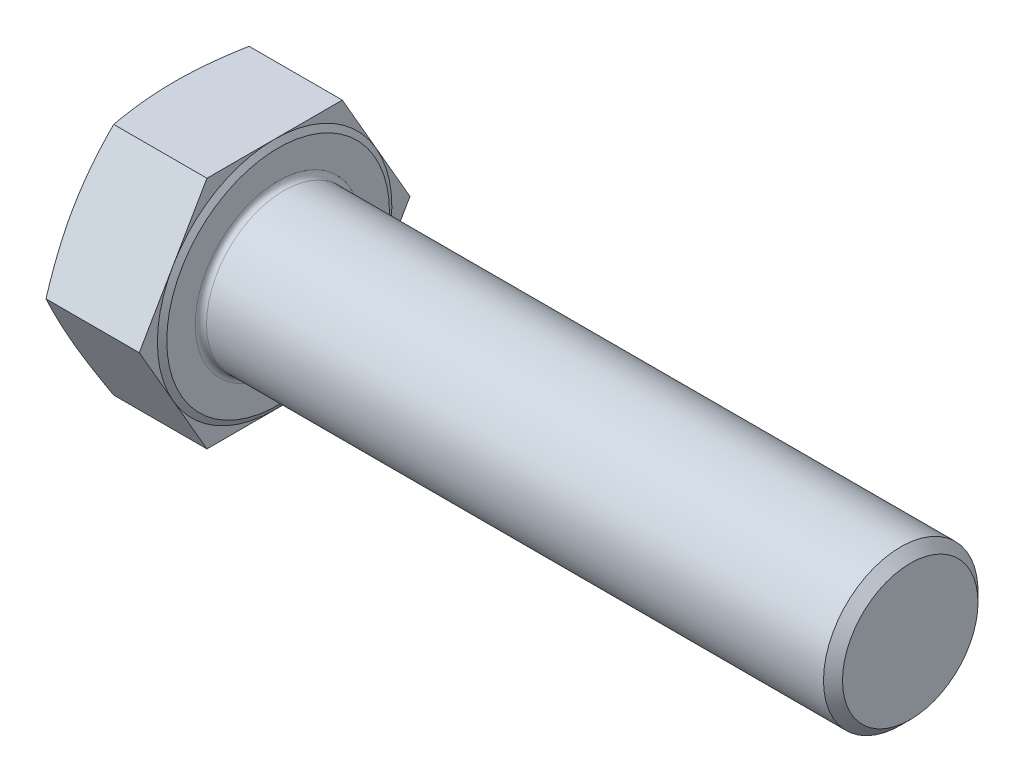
ISO-10303-21;
HEADER;
FILE_DESCRIPTION(('STEP AP214'),'2;1');
FILE_NAME('part.step','',(''),(''),'','','');
FILE_SCHEMA(('AUTOMOTIVE_DESIGN { 1 0 10303 214 1 1 1 1 }'));
ENDSEC;
DATA;
#1=APPLICATION_CONTEXT('core data for automotive mechanical design processes');
#2=APPLICATION_PROTOCOL_DEFINITION('international standard','automotive_design',2000,#1);
#3=PRODUCT_CONTEXT('',#1,'mechanical');
#4=PRODUCT('Part','Part','',(#3));
#5=PRODUCT_RELATED_PRODUCT_CATEGORY('part','',(#4));
#6=PRODUCT_DEFINITION_FORMATION('','',#4);
#7=PRODUCT_DEFINITION_CONTEXT('part definition',#1,'design');
#8=PRODUCT_DEFINITION('design','',#6,#7);
#9=PRODUCT_DEFINITION_SHAPE('','',#8);
#10=(LENGTH_UNIT() NAMED_UNIT(*) SI_UNIT(.MILLI.,.METRE.));
#11=(NAMED_UNIT(*) PLANE_ANGLE_UNIT() SI_UNIT($,.RADIAN.));
#12=(NAMED_UNIT(*) SI_UNIT($,.STERADIAN.) SOLID_ANGLE_UNIT());
#13=UNCERTAINTY_MEASURE_WITH_UNIT(LENGTH_MEASURE(1.E-05),#10,'distance_accuracy_value','');
#14=(GEOMETRIC_REPRESENTATION_CONTEXT(3) GLOBAL_UNCERTAINTY_ASSIGNED_CONTEXT((#13)) GLOBAL_UNIT_ASSIGNED_CONTEXT((#10,
#11,#12)) REPRESENTATION_CONTEXT('',''));
#15=CARTESIAN_POINT('',(0.,0.,0.));
#16=DIRECTION('',(0.,0.,1.));
#17=DIRECTION('',(1.,0.,0.));
#18=AXIS2_PLACEMENT_3D('',#15,#16,#17);
#19=CARTESIAN_POINT('',(14.72,0.,0.));
#20=DIRECTION('',(1.,0.,0.));
#21=DIRECTION('',(0.,0.,-1.));
#22=AXIS2_PLACEMENT_3D('',#19,#20,#21);
#23=PLANE('',#22);
#24=CARTESIAN_POINT('',(14.72,0.,0.));
#25=DIRECTION('',(1.,0.,0.));
#26=DIRECTION('',(0.,0.,-1.));
#27=AXIS2_PLACEMENT_3D('',#24,#25,#26);
#28=CIRCLE('',#27,11.8);
#29=CARTESIAN_POINT('',(14.72,0.,-11.8));
#30=VERTEX_POINT('',#29);
#31=EDGE_CURVE('E188',#30,#30,#28,.F.);
#32=ORIENTED_EDGE('',*,*,#31,.T.);
#33=EDGE_LOOP('',(#32));
#34=FACE_BOUND('',#33,.T.);
#35=CARTESIAN_POINT('',(14.72,0.,0.));
#36=DIRECTION('',(-1.,0.,0.));
#37=DIRECTION('',(0.,0.,1.));
#38=AXIS2_PLACEMENT_3D('',#35,#36,#37);
#39=CIRCLE('',#38,15.855);
#40=CARTESIAN_POINT('',(14.72,0.,15.855));
#41=VERTEX_POINT('',#40);
#42=EDGE_CURVE('E139',#41,#41,#39,.T.);
#43=ORIENTED_EDGE('',*,*,#42,.F.);
#44=EDGE_LOOP('',(#43));
#45=FACE_BOUND('',#44,.T.);
#46=ADVANCED_FACE('F33',(#34,#45),#23,.T.);
#47=CARTESIAN_POINT('',(14.22,0.,-19.2719519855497));
#48=DIRECTION('',(1.,0.,0.));
#49=DIRECTION('',(0.,0.,-1.));
#50=AXIS2_PLACEMENT_3D('',#47,#48,#49);
#51=PLANE('',#50);
#52=DIRECTION('',(0.,-0.866025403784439,0.5));
#53=VECTOR('',#52,1.);
#54=CARTESIAN_POINT('',(14.22,16.69,9.63597599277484));
#55=LINE('',#54,#53);
#56=CARTESIAN_POINT('',(14.22,16.69,9.63597599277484));
#57=VERTEX_POINT('',#56);
#58=CARTESIAN_POINT('',(14.22,8.345,14.4539639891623));
#59=VERTEX_POINT('',#58);
#60=EDGE_CURVE('E138',#57,#59,#55,.T.);
#61=ORIENTED_EDGE('',*,*,#60,.T.);
#62=CARTESIAN_POINT('',(14.22,0.,0.));
#63=DIRECTION('',(-1.,0.,0.));
#64=DIRECTION('',(0.,0.,1.));
#65=AXIS2_PLACEMENT_3D('',#62,#63,#64);
#66=CIRCLE('',#65,16.69);
#67=CARTESIAN_POINT('',(14.22,16.69,0.));
#68=VERTEX_POINT('',#67);
#69=EDGE_CURVE('E49',#59,#68,#66,.T.);
#70=ORIENTED_EDGE('',*,*,#69,.T.);
#71=DIRECTION('',(0.,0.,1.));
#72=VECTOR('',#71,1.);
#73=CARTESIAN_POINT('',(14.22,16.69,-9.63597599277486));
#74=LINE('',#73,#72);
#75=EDGE_CURVE('E135',#68,#57,#74,.T.);
#76=ORIENTED_EDGE('',*,*,#75,.T.);
#77=EDGE_LOOP('',(#61,#70,#76));
#78=FACE_BOUND('',#77,.T.);
#79=ADVANCED_FACE('F134',(#78),#51,.T.);
#80=CARTESIAN_POINT('',(14.22,16.69,-9.63597599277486));
#81=VERTEX_POINT('',#80);
#82=EDGE_CURVE('E145',#81,#68,#74,.T.);
#83=ORIENTED_EDGE('',*,*,#82,.T.);
#84=CARTESIAN_POINT('',(14.22,8.345,-14.4539639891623));
#85=VERTEX_POINT('',#84);
#86=EDGE_CURVE('E122',#68,#85,#66,.T.);
#87=ORIENTED_EDGE('',*,*,#86,.T.);
#88=DIRECTION('',(0.,0.866025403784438,0.5));
#89=VECTOR('',#88,1.);
#90=CARTESIAN_POINT('',(14.22,0.,-19.2719519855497));
#91=LINE('',#90,#89);
#92=EDGE_CURVE('E151',#85,#81,#91,.T.);
#93=ORIENTED_EDGE('',*,*,#92,.T.);
#94=EDGE_LOOP('',(#83,#87,#93));
#95=FACE_BOUND('',#94,.T.);
#96=ADVANCED_FACE('F150',(#95),#51,.T.);
#97=CARTESIAN_POINT('',(14.22,0.,-19.2719519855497));
#98=VERTEX_POINT('',#97);
#99=EDGE_CURVE('E148',#98,#85,#91,.T.);
#100=ORIENTED_EDGE('',*,*,#99,.T.);
#101=CARTESIAN_POINT('',(14.22,-8.345,-14.4539639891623));
#102=VERTEX_POINT('',#101);
#103=EDGE_CURVE('E125',#85,#102,#66,.T.);
#104=ORIENTED_EDGE('',*,*,#103,.T.);
#105=DIRECTION('',(0.,0.866025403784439,-0.5));
#106=VECTOR('',#105,1.);
#107=CARTESIAN_POINT('',(14.22,-16.69,-9.63597599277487));
#108=LINE('',#107,#106);
#109=EDGE_CURVE('E306',#102,#98,#108,.T.);
#110=ORIENTED_EDGE('',*,*,#109,.T.);
#111=EDGE_LOOP('',(#100,#104,#110));
#112=FACE_BOUND('',#111,.T.);
#113=ADVANCED_FACE('F337',(#112),#51,.T.);
#114=CARTESIAN_POINT('',(14.22,-16.69,-9.63597599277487));
#115=VERTEX_POINT('',#114);
#116=EDGE_CURVE('E304',#115,#102,#108,.T.);
#117=ORIENTED_EDGE('',*,*,#116,.T.);
#118=CARTESIAN_POINT('',(14.22,-16.69,0.));
#119=VERTEX_POINT('',#118);
#120=EDGE_CURVE('E338',#102,#119,#66,.T.);
#121=ORIENTED_EDGE('',*,*,#120,.T.);
#122=DIRECTION('',(0.,0.,-1.));
#123=VECTOR('',#122,1.);
#124=CARTESIAN_POINT('',(14.22,-16.69,9.63597599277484));
#125=LINE('',#124,#123);
#126=EDGE_CURVE('E162',#119,#115,#125,.T.);
#127=ORIENTED_EDGE('',*,*,#126,.T.);
#128=EDGE_LOOP('',(#117,#121,#127));
#129=FACE_BOUND('',#128,.T.);
#130=ADVANCED_FACE('F352',(#129),#51,.T.);
#131=CARTESIAN_POINT('',(14.22,-16.69,9.63597599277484));
#132=VERTEX_POINT('',#131);
#133=EDGE_CURVE('E163',#132,#119,#125,.T.);
#134=ORIENTED_EDGE('',*,*,#133,.T.);
#135=CARTESIAN_POINT('',(14.22,-8.345,14.4539639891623));
#136=VERTEX_POINT('',#135);
#137=EDGE_CURVE('E339',#119,#136,#66,.T.);
#138=ORIENTED_EDGE('',*,*,#137,.T.);
#139=DIRECTION('',(0.,-0.866025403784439,-0.5));
#140=VECTOR('',#139,1.);
#141=CARTESIAN_POINT('',(14.22,0.,19.2719519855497));
#142=LINE('',#141,#140);
#143=EDGE_CURVE('E158',#136,#132,#142,.T.);
#144=ORIENTED_EDGE('',*,*,#143,.T.);
#145=EDGE_LOOP('',(#134,#138,#144));
#146=FACE_BOUND('',#145,.T.);
#147=ADVANCED_FACE('F347',(#146),#51,.T.);
#148=CARTESIAN_POINT('',(14.22,0.,19.2719519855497));
#149=VERTEX_POINT('',#148);
#150=EDGE_CURVE('E159',#149,#136,#142,.T.);
#151=ORIENTED_EDGE('',*,*,#150,.T.);
#152=EDGE_CURVE('E140',#136,#59,#66,.T.);
#153=ORIENTED_EDGE('',*,*,#152,.T.);
#154=EDGE_CURVE('E153',#59,#149,#55,.T.);
#155=ORIENTED_EDGE('',*,*,#154,.T.);
#156=EDGE_LOOP('',(#151,#153,#155));
#157=FACE_BOUND('',#156,.T.);
#158=ADVANCED_FACE('F213',(#157),#51,.T.);
#159=CARTESIAN_POINT('',(14.22,-16.69,-9.63597599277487));
#160=DIRECTION('',(0.,0.5,0.866025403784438));
#161=DIRECTION('',(0.,-0.866025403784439,0.5));
#162=AXIS2_PLACEMENT_3D('',#159,#160,#161);
#163=PLANE('',#162);
#164=CARTESIAN_POINT('',(0.939795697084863,0.000200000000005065,-19.2720674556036));
#165=CARTESIAN_POINT('',(0.867168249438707,-0.345441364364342,-19.0725113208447));
#166=CARTESIAN_POINT('',(0.797807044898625,-0.691590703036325,-18.8726619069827));
#167=CARTESIAN_POINT('',(0.66633565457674,-1.38495249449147,-18.4723492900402));
#168=CARTESIAN_POINT('',(0.604226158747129,-1.7321650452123,-18.2718860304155));
#169=CARTESIAN_POINT('',(0.429792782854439,-2.7758502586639,-17.66931409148));
#170=CARTESIAN_POINT('',(0.329466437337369,-3.47389266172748,-17.2662991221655));
#171=CARTESIAN_POINT('',(0.207537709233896,-4.52008028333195,-16.6622824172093));
#172=CARTESIAN_POINT('',(0.1717582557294,-4.86701845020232,-16.4619775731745));
#173=CARTESIAN_POINT('',(0.109969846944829,-5.56154255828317,-16.0609938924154));
#174=CARTESIAN_POINT('',(0.083960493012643,-5.90912847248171,-15.8603150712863));
#175=CARTESIAN_POINT('',(0.0421666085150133,-6.60464256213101,-15.4587598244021));
#176=CARTESIAN_POINT('',(0.0263785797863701,-6.95257057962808,-15.2578834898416));
#177=CARTESIAN_POINT('',(0.00529529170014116,-7.64866573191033,-14.8559927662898));
#178=CARTESIAN_POINT('',(0.,-7.99683286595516,-14.6549783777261));
#179=CARTESIAN_POINT('',(0.,-8.69316713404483,-14.2529496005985));
#180=CARTESIAN_POINT('',(0.00529529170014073,-9.04133426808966,-14.0519352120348));
#181=CARTESIAN_POINT('',(0.0263785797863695,-9.73742942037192,-13.650044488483));
#182=CARTESIAN_POINT('',(0.0421666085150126,-10.085357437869,-13.4491681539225));
#183=CARTESIAN_POINT('',(0.0839604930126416,-10.7808715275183,-13.0476129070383));
#184=CARTESIAN_POINT('',(0.109969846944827,-11.1284574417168,-12.8469340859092));
#185=CARTESIAN_POINT('',(0.171758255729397,-11.8229815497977,-12.4459504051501));
#186=CARTESIAN_POINT('',(0.207537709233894,-12.169919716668,-12.2456455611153));
#187=CARTESIAN_POINT('',(0.329466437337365,-13.2161073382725,-11.6416288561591));
#188=CARTESIAN_POINT('',(0.429792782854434,-13.9141497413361,-11.2386138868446));
#189=CARTESIAN_POINT('',(0.604226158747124,-14.9578349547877,-10.6360419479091));
#190=CARTESIAN_POINT('',(0.666335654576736,-15.3050475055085,-10.4355786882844));
#191=CARTESIAN_POINT('',(0.797807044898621,-15.9984092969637,-10.0352660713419));
#192=CARTESIAN_POINT('',(0.867168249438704,-16.3445586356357,-9.83541665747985));
#193=CARTESIAN_POINT('',(0.939795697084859,-16.6902,-9.63586052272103));
#194=B_SPLINE_CURVE_WITH_KNOTS('',3,(#164,#165,#166,#167,#168,#169,#170,#171,#172,#173,#174,
#175,#176,#177,#178,#179,#180,#181,#182,#183,#184,#185,#186,#187,#188,#189,#190,#191,#192,#193),
.UNSPECIFIED.,.F.,.F.,(4,2,2,2,2,2,2,2,2,2,2,2,2,2,4),(0.,1.21696349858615,2.43404268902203,
4.86988356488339,6.07640128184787,7.28286976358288,8.48892512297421,9.69497676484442,
10.9010284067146,12.107083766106,13.313552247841,14.5200699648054,16.9559108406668,
18.1729900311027,19.3899535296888),.UNSPECIFIED.);
#195=CARTESIAN_POINT('',(0.939753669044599,0.,-19.2719519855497));
#196=VERTEX_POINT('',#195);
#197=CARTESIAN_POINT('',(0.,-8.345,-14.4539639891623));
#198=VERTEX_POINT('',#197);
#199=EDGE_CURVE('E321',#196,#198,#194,.T.);
#200=ORIENTED_EDGE('',*,*,#199,.F.);
#201=DIRECTION('',(-1.,0.,0.));
#202=VECTOR('',#201,1.);
#203=CARTESIAN_POINT('',(14.22,0.,-19.2719519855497));
#204=LINE('',#203,#202);
#205=EDGE_CURVE('E178',#98,#196,#204,.T.);
#206=ORIENTED_EDGE('',*,*,#205,.F.);
#207=ORIENTED_EDGE('',*,*,#109,.F.);
#208=ORIENTED_EDGE('',*,*,#116,.F.);
#209=DIRECTION('',(-1.,0.,0.));
#210=VECTOR('',#209,1.);
#211=CARTESIAN_POINT('',(14.22,-16.69,-9.63597599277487));
#212=LINE('',#211,#210);
#213=CARTESIAN_POINT('',(0.9397536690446,-16.69,-9.6359759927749));
#214=VERTEX_POINT('',#213);
#215=EDGE_CURVE('E166',#115,#214,#212,.T.);
#216=ORIENTED_EDGE('',*,*,#215,.T.);
#217=EDGE_CURVE('E246',#198,#214,#194,.T.);
#218=ORIENTED_EDGE('',*,*,#217,.F.);
#219=EDGE_LOOP('',(#200,#206,#207,#208,#216,#218));
#220=FACE_BOUND('',#219,.T.);
#221=ADVANCED_FACE('F35',(#220),#163,.F.);
#222=CARTESIAN_POINT('',(14.22,0.,-19.2719519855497));
#223=DIRECTION('',(0.,-0.5,0.866025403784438));
#224=DIRECTION('',(0.,-0.866025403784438,-0.5));
#225=AXIS2_PLACEMENT_3D('',#222,#223,#224);
#226=PLANE('',#225);
#227=CARTESIAN_POINT('',(0.939795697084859,16.6902,-9.63586052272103));
#228=CARTESIAN_POINT('',(0.867168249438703,16.3445586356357,-9.83541665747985));
#229=CARTESIAN_POINT('',(0.79780704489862,15.9984092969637,-10.0352660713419));
#230=CARTESIAN_POINT('',(0.666335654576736,15.3050475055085,-10.4355786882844));
#231=CARTESIAN_POINT('',(0.604226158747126,14.9578349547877,-10.6360419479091));
#232=CARTESIAN_POINT('',(0.429792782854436,13.9141497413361,-11.2386138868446));
#233=CARTESIAN_POINT('',(0.329466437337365,13.2161073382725,-11.6416288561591));
#234=CARTESIAN_POINT('',(0.207537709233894,12.169919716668,-12.2456455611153));
#235=CARTESIAN_POINT('',(0.171758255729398,11.8229815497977,-12.4459504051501));
#236=CARTESIAN_POINT('',(0.109969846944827,11.1284574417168,-12.8469340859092));
#237=CARTESIAN_POINT('',(0.0839604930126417,10.7808715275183,-13.0476129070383));
#238=CARTESIAN_POINT('',(0.0421666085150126,10.085357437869,-13.4491681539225));
#239=CARTESIAN_POINT('',(0.0263785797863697,9.73742942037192,-13.650044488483));
#240=CARTESIAN_POINT('',(0.00529529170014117,9.04133426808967,-14.0519352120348));
#241=CARTESIAN_POINT('',(0.,8.69316713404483,-14.2529496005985));
#242=CARTESIAN_POINT('',(0.,7.99683286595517,-14.6549783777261));
#243=CARTESIAN_POINT('',(0.00529529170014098,7.64866573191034,-14.8559927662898));
#244=CARTESIAN_POINT('',(0.0263785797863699,6.95257057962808,-15.2578834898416));
#245=CARTESIAN_POINT('',(0.0421666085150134,6.60464256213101,-15.4587598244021));
#246=CARTESIAN_POINT('',(0.0839604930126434,5.90912847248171,-15.8603150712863));
#247=CARTESIAN_POINT('',(0.109969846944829,5.56154255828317,-16.0609938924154));
#248=CARTESIAN_POINT('',(0.1717582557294,4.86701845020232,-16.4619775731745));
#249=CARTESIAN_POINT('',(0.207537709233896,4.52008028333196,-16.6622824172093));
#250=CARTESIAN_POINT('',(0.329466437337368,3.47389266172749,-17.2662991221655));
#251=CARTESIAN_POINT('',(0.429792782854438,2.77585025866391,-17.66931409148));
#252=CARTESIAN_POINT('',(0.604226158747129,1.73216504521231,-18.2718860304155));
#253=CARTESIAN_POINT('',(0.66633565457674,1.38495249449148,-18.4723492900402));
#254=CARTESIAN_POINT('',(0.797807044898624,0.691590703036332,-18.8726619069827));
#255=CARTESIAN_POINT('',(0.867168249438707,0.345441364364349,-19.0725113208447));
#256=CARTESIAN_POINT('',(0.939795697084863,-0.000199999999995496,-19.2720674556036));
#257=B_SPLINE_CURVE_WITH_KNOTS('',3,(#227,#228,#229,#230,#231,#232,#233,#234,#235,#236,#237,
#238,#239,#240,#241,#242,#243,#244,#245,#246,#247,#248,#249,#250,#251,#252,#253,#254,#255,#256),
.UNSPECIFIED.,.F.,.F.,(4,2,2,2,2,2,2,2,2,2,2,2,2,2,4),(0.,1.21696349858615,2.43404268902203,
4.86988356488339,6.07640128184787,7.28286976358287,8.4889251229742,9.69497676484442,
10.9010284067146,12.107083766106,13.313552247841,14.5200699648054,16.9559108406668,
18.1729900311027,19.3899535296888),.UNSPECIFIED.);
#258=CARTESIAN_POINT('',(0.9397536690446,16.69,-9.6359759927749));
#259=VERTEX_POINT('',#258);
#260=CARTESIAN_POINT('',(0.,8.34500000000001,-14.4539639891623));
#261=VERTEX_POINT('',#260);
#262=EDGE_CURVE('E261',#259,#261,#257,.T.);
#263=ORIENTED_EDGE('',*,*,#262,.F.);
#264=DIRECTION('',(-1.,0.,0.));
#265=VECTOR('',#264,1.);
#266=CARTESIAN_POINT('',(14.22,16.69,-9.63597599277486));
#267=LINE('',#266,#265);
#268=EDGE_CURVE('E176',#81,#259,#267,.T.);
#269=ORIENTED_EDGE('',*,*,#268,.F.);
#270=ORIENTED_EDGE('',*,*,#92,.F.);
#271=ORIENTED_EDGE('',*,*,#99,.F.);
#272=ORIENTED_EDGE('',*,*,#205,.T.);
#273=EDGE_CURVE('E257',#261,#196,#257,.T.);
#274=ORIENTED_EDGE('',*,*,#273,.F.);
#275=EDGE_LOOP('',(#263,#269,#270,#271,#272,#274));
#276=FACE_BOUND('',#275,.T.);
#277=ADVANCED_FACE('F267',(#276),#226,.F.);
#278=CARTESIAN_POINT('',(14.22,16.69,-9.63597599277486));
#279=DIRECTION('',(0.,-1.,0.));
#280=DIRECTION('',(0.,0.,-1.));
#281=AXIS2_PLACEMENT_3D('',#278,#279,#280);
#282=PLANE('',#281);
#283=CARTESIAN_POINT('',(5.02167182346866,16.69,-25.5126791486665));
#284=CARTESIAN_POINT('',(4.90667743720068,16.69,-25.1351266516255));
#285=CARTESIAN_POINT('',(4.79237848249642,16.69,-24.7573624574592));
#286=CARTESIAN_POINT('',(4.56532712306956,16.69,-24.0013672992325));
#287=CARTESIAN_POINT('',(4.45257472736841,16.69,-23.6231363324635));
#288=CARTESIAN_POINT('',(4.11685637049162,16.69,-22.4876288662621));
#289=CARTESIAN_POINT('',(3.89644628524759,16.69,-21.7295936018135));
#290=CARTESIAN_POINT('',(3.46360835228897,16.69,-20.2097125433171));
#291=CARTESIAN_POINT('',(3.25119616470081,16.69,-19.4478622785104));
#292=CARTESIAN_POINT('',(2.83682259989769,16.69,-17.9213281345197));
#293=CARTESIAN_POINT('',(2.63486103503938,16.69,-17.1566443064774));
#294=CARTESIAN_POINT('',(2.24639245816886,16.69,-15.6333822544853));
#295=CARTESIAN_POINT('',(2.05972560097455,16.69,-14.8748449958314));
#296=CARTESIAN_POINT('',(1.70228407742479,16.69,-13.3539959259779));
#297=CARTESIAN_POINT('',(1.53150967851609,16.69,-12.5916840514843));
#298=CARTESIAN_POINT('',(1.20983486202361,16.69,-11.0631151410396));
#299=CARTESIAN_POINT('',(1.05892766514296,16.69,-10.2968595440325));
#300=CARTESIAN_POINT('',(0.781582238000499,16.69,-8.75989970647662));
#301=CARTESIAN_POINT('',(0.65514318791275,16.69,-7.98919561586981));
#302=CARTESIAN_POINT('',(0.444389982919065,16.69,-6.53012323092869));
#303=CARTESIAN_POINT('',(0.356942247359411,16.69,-5.84221181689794));
#304=CARTESIAN_POINT('',(0.208914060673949,16.69,-4.46348015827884));
#305=CARTESIAN_POINT('',(0.148332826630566,16.69,-3.77265999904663));
#306=CARTESIAN_POINT('',(0.0569551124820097,16.69,-2.38951208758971));
#307=CARTESIAN_POINT('',(0.0261375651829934,16.69,-1.69718574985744));
#308=CARTESIAN_POINT('',(-0.00415248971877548,16.69,-0.31184041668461));
#309=CARTESIAN_POINT('',(-0.00362521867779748,16.69,0.381178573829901));
#310=CARTESIAN_POINT('',(0.0288278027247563,16.69,1.76998534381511));
#311=CARTESIAN_POINT('',(0.0609127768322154,16.69,2.46576934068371));
#312=CARTESIAN_POINT('',(0.155004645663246,16.69,3.85529364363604));
#313=CARTESIAN_POINT('',(0.217012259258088,16.69,4.54903390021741));
#314=CARTESIAN_POINT('',(0.368048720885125,16.69,5.93412816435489));
#315=CARTESIAN_POINT('',(0.457100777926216,16.69,6.6254796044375));
#316=CARTESIAN_POINT('',(0.658613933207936,16.69,8.00472382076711));
#317=CARTESIAN_POINT('',(0.771075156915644,16.69,8.69261657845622));
#318=CARTESIAN_POINT('',(1.02221793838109,16.69,10.1011415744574));
#319=CARTESIAN_POINT('',(1.16197176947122,16.69,10.8215809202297));
#320=CARTESIAN_POINT('',(1.45946657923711,16.69,12.2587599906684));
#321=CARTESIAN_POINT('',(1.61720891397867,16.69,12.975499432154));
#322=CARTESIAN_POINT('',(1.94736846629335,16.69,14.405789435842));
#323=CARTESIAN_POINT('',(2.11978994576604,16.69,15.1193390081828));
#324=CARTESIAN_POINT('',(2.47650299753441,16.69,16.5434322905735));
#325=CARTESIAN_POINT('',(2.66079428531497,16.69,17.2539760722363));
#326=CARTESIAN_POINT('',(3.03927108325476,16.69,18.6733916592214));
#327=CARTESIAN_POINT('',(3.23346899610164,16.69,19.3822601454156));
#328=CARTESIAN_POINT('',(3.62976461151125,16.69,20.7977824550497));
#329=CARTESIAN_POINT('',(3.83186234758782,16.69,21.5044362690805));
#330=CARTESIAN_POINT('',(4.2425115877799,16.69,22.9157335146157));
#331=CARTESIAN_POINT('',(4.45106200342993,16.69,23.6203772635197));
#332=CARTESIAN_POINT('',(4.87352810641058,16.69,25.0280501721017));
#333=CARTESIAN_POINT('',(5.0874437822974,16.69,25.7310793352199));
#334=CARTESIAN_POINT('',(5.51735863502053,16.69,27.1280048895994));
#335=CARTESIAN_POINT('',(5.73330872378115,16.69,27.8219164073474));
#336=CARTESIAN_POINT('',(6.16889217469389,16.69,29.208583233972));
#337=CARTESIAN_POINT('',(6.3885255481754,16.69,29.9013385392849));
#338=CARTESIAN_POINT('',(7.05209577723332,16.69,31.9781786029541));
#339=CARTESIAN_POINT('',(7.50068426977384,16.69,33.3607778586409));
#340=CARTESIAN_POINT('',(8.17950202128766,16.69,35.4298165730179));
#341=CARTESIAN_POINT('',(8.40632546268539,16.69,36.117379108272));
#342=CARTESIAN_POINT('',(8.86193408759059,16.69,37.4918549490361));
#343=CARTESIAN_POINT('',(9.09071927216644,16.69,38.1787682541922));
#344=CARTESIAN_POINT('',(9.5499691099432,16.69,39.5519701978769));
#345=CARTESIAN_POINT('',(9.78043362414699,16.69,40.2382588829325));
#346=CARTESIAN_POINT('',(10.2428539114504,16.69,41.6103318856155));
#347=CARTESIAN_POINT('',(10.474809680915,16.69,42.2961162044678));
#348=CARTESIAN_POINT('',(10.7074082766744,16.69,42.9816820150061));
#349=B_SPLINE_CURVE_WITH_KNOTS('',3,(#283,#284,#285,#286,#287,#288,#289,#290,#291,#292,#293,
#294,#295,#296,#297,#298,#299,#300,#301,#302,#303,#304,#305,#306,#307,#308,#309,#310,#311,#312,
#313,#314,#315,#316,#317,#318,#319,#320,#321,#322,#323,#324,#325,#326,#327,#328,#329,#330,#331,
#332,#333,#334,#335,#336,#337,#338,#339,#340,#341,#342,#343,#344,#345,#346,#347,#348),
.UNSPECIFIED.,.F.,.F.,(4,2,2,2,2,2,2,2,2,2,2,2,2,2,2,2,2,2,2,2,2,2,2,2,2,2,2,2,2,2,2,2,4),(0.,
1.18402845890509,2.36806382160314,4.73630958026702,7.10897389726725,9.48159559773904,
11.8249641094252,14.1683720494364,16.5109782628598,18.8535059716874,20.9333912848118,
23.0132159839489,25.0915674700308,27.1699042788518,29.258781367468,31.3477086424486,
33.4384336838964,35.5291699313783,37.7304959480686,39.9319880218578,42.1341214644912,
44.3362021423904,46.5411108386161,48.7460288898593,50.9505770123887,53.1551204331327,
55.3353212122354,57.515528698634,61.8761309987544,64.048160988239,66.2201921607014,
68.3920455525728,70.5638936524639),.UNSPECIFIED.);
#350=CARTESIAN_POINT('',(0.939753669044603,16.69,9.63597599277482));
#351=VERTEX_POINT('',#350);
#352=CARTESIAN_POINT('',(0.,16.69,0.));
#353=VERTEX_POINT('',#352);
#354=EDGE_CURVE('E57',#351,#353,#349,.F.);
#355=ORIENTED_EDGE('',*,*,#354,.F.);
#356=DIRECTION('',(-1.,0.,0.));
#357=VECTOR('',#356,1.);
#358=CARTESIAN_POINT('',(14.22,16.69,9.63597599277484));
#359=LINE('',#358,#357);
#360=EDGE_CURVE('E147',#57,#351,#359,.T.);
#361=ORIENTED_EDGE('',*,*,#360,.F.);
#362=ORIENTED_EDGE('',*,*,#75,.F.);
#363=ORIENTED_EDGE('',*,*,#82,.F.);
#364=ORIENTED_EDGE('',*,*,#268,.T.);
#365=EDGE_CURVE('E262',#353,#259,#349,.F.);
#366=ORIENTED_EDGE('',*,*,#365,.F.);
#367=EDGE_LOOP('',(#355,#361,#362,#363,#364,#366));
#368=FACE_BOUND('',#367,.T.);
#369=ADVANCED_FACE('F143',(#368),#282,.F.);
#370=CARTESIAN_POINT('',(14.22,16.69,9.63597599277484));
#371=DIRECTION('',(0.,-0.5,-0.866025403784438));
#372=DIRECTION('',(0.,0.866025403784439,-0.5));
#373=AXIS2_PLACEMENT_3D('',#370,#371,#372);
#374=PLANE('',#373);
#375=CARTESIAN_POINT('',(0.939795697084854,-0.00019999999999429,19.2720674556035));
#376=CARTESIAN_POINT('',(0.867168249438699,0.345441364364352,19.0725113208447));
#377=CARTESIAN_POINT('',(0.797807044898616,0.691590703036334,18.8726619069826));
#378=CARTESIAN_POINT('',(0.666335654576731,1.38495249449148,18.4723492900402));
#379=CARTESIAN_POINT('',(0.60422615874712,1.73216504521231,18.2718860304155));
#380=CARTESIAN_POINT('',(0.42979278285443,2.77585025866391,17.66931409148));
#381=CARTESIAN_POINT('',(0.329466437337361,3.47389266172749,17.2662991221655));
#382=CARTESIAN_POINT('',(0.207537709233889,4.52008028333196,16.6622824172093));
#383=CARTESIAN_POINT('',(0.171758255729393,4.86701845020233,16.4619775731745));
#384=CARTESIAN_POINT('',(0.109969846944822,5.56154255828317,16.0609938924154));
#385=CARTESIAN_POINT('',(0.0839604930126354,5.90912847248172,15.8603150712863));
#386=CARTESIAN_POINT('',(0.0421666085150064,6.60464256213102,15.4587598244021));
#387=CARTESIAN_POINT('',(0.0263785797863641,6.95257057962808,15.2578834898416));
#388=CARTESIAN_POINT('',(0.00529529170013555,7.64866573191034,14.8559927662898));
#389=CARTESIAN_POINT('',(0.,7.99683286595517,14.654978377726));
#390=CARTESIAN_POINT('',(0.,8.69316713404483,14.2529496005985));
#391=CARTESIAN_POINT('',(0.00529529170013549,9.04133426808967,14.0519352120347));
#392=CARTESIAN_POINT('',(0.0263785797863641,9.73742942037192,13.650044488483));
#393=CARTESIAN_POINT('',(0.0421666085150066,10.085357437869,13.4491681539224));
#394=CARTESIAN_POINT('',(0.0839604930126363,10.7808715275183,13.0476129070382));
#395=CARTESIAN_POINT('',(0.109969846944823,11.1284574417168,12.8469340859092));
#396=CARTESIAN_POINT('',(0.171758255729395,11.8229815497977,12.44595040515));
#397=CARTESIAN_POINT('',(0.20753770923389,12.169919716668,12.2456455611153));
#398=CARTESIAN_POINT('',(0.329466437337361,13.2161073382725,11.6416288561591));
#399=CARTESIAN_POINT('',(0.429792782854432,13.9141497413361,11.2386138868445));
#400=CARTESIAN_POINT('',(0.604226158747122,14.9578349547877,10.636041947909));
#401=CARTESIAN_POINT('',(0.666335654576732,15.3050475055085,10.4355786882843));
#402=CARTESIAN_POINT('',(0.797807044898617,15.9984092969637,10.0352660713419));
#403=CARTESIAN_POINT('',(0.867168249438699,16.3445586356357,9.83541665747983));
#404=CARTESIAN_POINT('',(0.939795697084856,16.6902,9.635860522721));
#405=B_SPLINE_CURVE_WITH_KNOTS('',3,(#375,#376,#377,#378,#379,#380,#381,#382,#383,#384,#385,
#386,#387,#388,#389,#390,#391,#392,#393,#394,#395,#396,#397,#398,#399,#400,#401,#402,#403,#404),
.UNSPECIFIED.,.F.,.F.,(4,2,2,2,2,2,2,2,2,2,2,2,2,2,4),(0.,1.21696349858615,2.43404268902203,
4.86988356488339,6.07640128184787,7.28286976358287,8.4889251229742,9.69497676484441,
10.9010284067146,12.107083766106,13.313552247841,14.5200699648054,16.9559108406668,
18.1729900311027,19.3899535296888),.UNSPECIFIED.);
#406=CARTESIAN_POINT('',(0.939753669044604,0.,19.2719519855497));
#407=VERTEX_POINT('',#406);
#408=CARTESIAN_POINT('',(0.,8.34500000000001,14.4539639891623));
#409=VERTEX_POINT('',#408);
#410=EDGE_CURVE('E251',#407,#409,#405,.T.);
#411=ORIENTED_EDGE('',*,*,#410,.F.);
#412=DIRECTION('',(-1.,0.,0.));
#413=VECTOR('',#412,1.);
#414=CARTESIAN_POINT('',(14.22,0.,19.2719519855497));
#415=LINE('',#414,#413);
#416=EDGE_CURVE('E172',#149,#407,#415,.T.);
#417=ORIENTED_EDGE('',*,*,#416,.F.);
#418=ORIENTED_EDGE('',*,*,#154,.F.);
#419=ORIENTED_EDGE('',*,*,#60,.F.);
#420=ORIENTED_EDGE('',*,*,#360,.T.);
#421=EDGE_CURVE('E312',#409,#351,#405,.T.);
#422=ORIENTED_EDGE('',*,*,#421,.F.);
#423=EDGE_LOOP('',(#411,#417,#418,#419,#420,#422));
#424=FACE_BOUND('',#423,.T.);
#425=ADVANCED_FACE('F273',(#424),#374,.F.);
#426=CARTESIAN_POINT('',(14.22,0.,19.2719519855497));
#427=DIRECTION('',(0.,0.5,-0.866025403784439));
#428=DIRECTION('',(0.,0.866025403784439,0.5));
#429=AXIS2_PLACEMENT_3D('',#426,#427,#428);
#430=PLANE('',#429);
#431=CARTESIAN_POINT('',(0.939795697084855,-16.6902,9.635860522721));
#432=CARTESIAN_POINT('',(0.867168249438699,-16.3445586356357,9.83541665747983));
#433=CARTESIAN_POINT('',(0.797807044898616,-15.9984092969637,10.0352660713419));
#434=CARTESIAN_POINT('',(0.666335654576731,-15.3050475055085,10.4355786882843));
#435=CARTESIAN_POINT('',(0.60422615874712,-14.9578349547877,10.636041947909));
#436=CARTESIAN_POINT('',(0.429792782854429,-13.9141497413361,11.2386138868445));
#437=CARTESIAN_POINT('',(0.329466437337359,-13.2161073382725,11.6416288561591));
#438=CARTESIAN_POINT('',(0.207537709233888,-12.169919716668,12.2456455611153));
#439=CARTESIAN_POINT('',(0.171758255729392,-11.8229815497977,12.44595040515));
#440=CARTESIAN_POINT('',(0.109969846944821,-11.1284574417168,12.8469340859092));
#441=CARTESIAN_POINT('',(0.0839604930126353,-10.7808715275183,13.0476129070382));
#442=CARTESIAN_POINT('',(0.0421666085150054,-10.085357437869,13.4491681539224));
#443=CARTESIAN_POINT('',(0.026378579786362,-9.73742942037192,13.650044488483));
#444=CARTESIAN_POINT('',(0.00529529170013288,-9.04133426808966,14.0519352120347));
#445=CARTESIAN_POINT('',(0.,-8.69316713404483,14.2529496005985));
#446=CARTESIAN_POINT('',(0.,-7.99683286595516,14.654978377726));
#447=CARTESIAN_POINT('',(0.00529529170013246,-7.64866573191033,14.8559927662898));
#448=CARTESIAN_POINT('',(0.0263785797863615,-6.95257057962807,15.2578834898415));
#449=CARTESIAN_POINT('',(0.0421666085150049,-6.60464256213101,15.4587598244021));
#450=CARTESIAN_POINT('',(0.0839604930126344,-5.90912847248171,15.8603150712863));
#451=CARTESIAN_POINT('',(0.10996984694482,-5.56154255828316,16.0609938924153));
#452=CARTESIAN_POINT('',(0.17175825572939,-4.86701845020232,16.4619775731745));
#453=CARTESIAN_POINT('',(0.207537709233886,-4.52008028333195,16.6622824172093));
#454=CARTESIAN_POINT('',(0.329466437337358,-3.47389266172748,17.2662991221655));
#455=CARTESIAN_POINT('',(0.429792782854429,-2.7758502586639,17.66931409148));
#456=CARTESIAN_POINT('',(0.60422615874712,-1.7321650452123,18.2718860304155));
#457=CARTESIAN_POINT('',(0.666335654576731,-1.38495249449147,18.4723492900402));
#458=CARTESIAN_POINT('',(0.797807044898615,-0.691590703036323,18.8726619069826));
#459=CARTESIAN_POINT('',(0.867168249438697,-0.34544136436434,19.0725113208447));
#460=CARTESIAN_POINT('',(0.939795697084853,0.000200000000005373,19.2720674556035));
#461=B_SPLINE_CURVE_WITH_KNOTS('',3,(#431,#432,#433,#434,#435,#436,#437,#438,#439,#440,#441,
#442,#443,#444,#445,#446,#447,#448,#449,#450,#451,#452,#453,#454,#455,#456,#457,#458,#459,#460),
.UNSPECIFIED.,.F.,.F.,(4,2,2,2,2,2,2,2,2,2,2,2,2,2,4),(0.,1.21696349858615,2.43404268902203,
4.86988356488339,6.07640128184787,7.28286976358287,8.4889251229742,9.69497676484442,
10.9010284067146,12.107083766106,13.313552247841,14.5200699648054,16.9559108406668,
18.1729900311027,19.3899535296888),.UNSPECIFIED.);
#462=CARTESIAN_POINT('',(0.939753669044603,-16.69,9.6359759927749));
#463=VERTEX_POINT('',#462);
#464=CARTESIAN_POINT('',(0.,-8.345,14.4539639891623));
#465=VERTEX_POINT('',#464);
#466=EDGE_CURVE('E239',#463,#465,#461,.T.);
#467=ORIENTED_EDGE('',*,*,#466,.F.);
#468=DIRECTION('',(-1.,0.,0.));
#469=VECTOR('',#468,1.);
#470=CARTESIAN_POINT('',(14.22,-16.69,9.63597599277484));
#471=LINE('',#470,#469);
#472=EDGE_CURVE('E169',#132,#463,#471,.T.);
#473=ORIENTED_EDGE('',*,*,#472,.F.);
#474=ORIENTED_EDGE('',*,*,#143,.F.);
#475=ORIENTED_EDGE('',*,*,#150,.F.);
#476=ORIENTED_EDGE('',*,*,#416,.T.);
#477=EDGE_CURVE('E317',#465,#407,#461,.T.);
#478=ORIENTED_EDGE('',*,*,#477,.F.);
#479=EDGE_LOOP('',(#467,#473,#474,#475,#476,#478));
#480=FACE_BOUND('',#479,.T.);
#481=ADVANCED_FACE('F276',(#480),#430,.F.);
#482=CARTESIAN_POINT('',(14.22,-16.69,9.63597599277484));
#483=DIRECTION('',(0.,1.,0.));
#484=DIRECTION('',(0.,0.,1.));
#485=AXIS2_PLACEMENT_3D('',#482,#483,#484);
#486=PLANE('',#485);
#487=CARTESIAN_POINT('',(5.02167092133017,-16.69,-25.5126761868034));
#488=CARTESIAN_POINT('',(4.90667655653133,-16.69,-25.135123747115));
#489=CARTESIAN_POINT('',(4.79237762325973,-16.69,-24.7573596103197));
#490=CARTESIAN_POINT('',(4.56532630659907,-16.69,-24.0013645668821));
#491=CARTESIAN_POINT('',(4.45257393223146,-16.69,-23.623133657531));
#492=CARTESIAN_POINT('',(4.11685563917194,-16.69,-22.4876263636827));
#493=CARTESIAN_POINT('',(3.89644559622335,-16.69,-21.7295912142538));
#494=CARTESIAN_POINT('',(3.46360774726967,-16.69,-20.2097103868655));
#495=CARTESIAN_POINT('',(3.25119560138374,-16.69,-19.4478602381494));
#496=CARTESIAN_POINT('',(2.83682211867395,-16.69,-17.9213263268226));
#497=CARTESIAN_POINT('',(2.63486059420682,-16.69,-17.1566426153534));
#498=CARTESIAN_POINT('',(2.24639209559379,-16.69,-15.6333807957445));
#499=CARTESIAN_POINT('',(2.0597252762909,-16.69,-14.8748436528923));
#500=CARTESIAN_POINT('',(1.70228382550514,-16.69,-13.3539948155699));
#501=CARTESIAN_POINT('',(1.53150946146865,-16.69,-12.5916830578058));
#502=CARTESIAN_POINT('',(1.20983471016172,-16.69,-11.0631143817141));
#503=CARTESIAN_POINT('',(1.05892754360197,-16.69,-10.2968589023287));
#504=CARTESIAN_POINT('',(0.781582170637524,-16.69,-8.75989930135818));
#505=CARTESIAN_POINT('',(0.655143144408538,-16.69,-7.98919532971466));
#506=CARTESIAN_POINT('',(0.444389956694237,-16.69,-6.53012303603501));
#507=CARTESIAN_POINT('',(0.356942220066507,-16.69,-5.84221159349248));
#508=CARTESIAN_POINT('',(0.208914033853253,-16.69,-4.46347987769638));
#509=CARTESIAN_POINT('',(0.148332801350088,-16.69,-3.77265968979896));
#510=CARTESIAN_POINT('',(0.0569550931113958,-16.69,-2.38951172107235));
#511=CARTESIAN_POINT('',(0.0261375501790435,-16.69,-1.69718535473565));
#512=CARTESIAN_POINT('',(-0.00415249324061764,-16.69,-0.311839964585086));
#513=CARTESIAN_POINT('',(-0.00362521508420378,-16.69,0.381179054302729));
#514=CARTESIAN_POINT('',(0.0288278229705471,-16.69,1.76998588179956));
#515=CARTESIAN_POINT('',(0.0609128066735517,-16.69,2.46576990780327));
#516=CARTESIAN_POINT('',(0.155004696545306,-16.69,3.85529426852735));
#517=CARTESIAN_POINT('',(0.21701232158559,-16.69,4.54903455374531));
#518=CARTESIAN_POINT('',(0.368048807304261,-16.69,5.93412887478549));
#519=CARTESIAN_POINT('',(0.457100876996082,-16.69,6.62548034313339));
#520=CARTESIAN_POINT('',(0.658614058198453,-16.69,8.00472461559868));
#521=CARTESIAN_POINT('',(0.771075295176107,-16.69,8.69261740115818));
#522=CARTESIAN_POINT('',(1.02221809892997,-16.69,10.1011424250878));
#523=CARTESIAN_POINT('',(1.16197193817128,-16.69,10.8215817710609));
#524=CARTESIAN_POINT('',(1.45946676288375,-16.69,12.2587608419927));
#525=CARTESIAN_POINT('',(1.61720910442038,-16.69,12.9755002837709));
#526=CARTESIAN_POINT('',(1.94736866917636,-16.69,14.4057902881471));
#527=CARTESIAN_POINT('',(2.11979015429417,-16.69,15.1193398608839));
#528=CARTESIAN_POINT('',(2.47650321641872,-16.69,16.5434331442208));
#529=CARTESIAN_POINT('',(2.66079450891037,-16.69,17.2539769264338));
#530=CARTESIAN_POINT('',(3.03927131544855,-16.69,18.6733925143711));
#531=CARTESIAN_POINT('',(3.23346923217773,-16.69,19.3822610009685));
#532=CARTESIAN_POINT('',(3.62976485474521,-16.69,20.797783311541));
#533=CARTESIAN_POINT('',(3.83186259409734,-16.69,21.504437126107));
#534=CARTESIAN_POINT('',(4.2425118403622,-16.69,22.9157343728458));
#535=CARTESIAN_POINT('',(4.45106225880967,-16.69,23.620378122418));
#536=CARTESIAN_POINT('',(4.87352836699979,-16.69,25.0280510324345));
#537=CARTESIAN_POINT('',(5.08744404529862,-16.69,25.7310801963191));
#538=CARTESIAN_POINT('',(5.51735890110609,-16.69,27.1280057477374));
#539=CARTESIAN_POINT('',(5.73330899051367,-16.69,27.8219172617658));
#540=CARTESIAN_POINT('',(6.16889244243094,-16.69,29.2085840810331));
#541=CARTESIAN_POINT('',(6.38852581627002,-16.69,29.9013393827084));
#542=CARTESIAN_POINT('',(7.05209604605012,-16.69,31.9781794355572));
#543=CARTESIAN_POINT('',(7.50068453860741,-16.69,33.3607786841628));
#544=CARTESIAN_POINT('',(8.17950228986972,-16.69,35.4298173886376));
#545=CARTESIAN_POINT('',(8.4063257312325,-16.69,36.1173799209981));
#546=CARTESIAN_POINT('',(8.86193435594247,-16.69,37.4918557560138));
#547=CARTESIAN_POINT('',(9.09071954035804,-16.69,38.1787690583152));
#548=CARTESIAN_POINT('',(9.54996937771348,-16.69,39.5519709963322));
#549=CARTESIAN_POINT('',(9.78043389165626,-16.69,40.2382596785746));
#550=CARTESIAN_POINT('',(10.2428541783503,-16.69,41.6103326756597));
#551=CARTESIAN_POINT('',(10.4748099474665,-16.69,42.2961169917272));
#552=CARTESIAN_POINT('',(10.7074085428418,-16.69,42.9816827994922));
#553=B_SPLINE_CURVE_WITH_KNOTS('',3,(#487,#488,#489,#490,#491,#492,#493,#494,#495,#496,#497,
#498,#499,#500,#501,#502,#503,#504,#505,#506,#507,#508,#509,#510,#511,#512,#513,#514,#515,#516,
#517,#518,#519,#520,#521,#522,#523,#524,#525,#526,#527,#528,#529,#530,#531,#532,#533,#534,#535,
#536,#537,#538,#539,#540,#541,#542,#543,#544,#545,#546,#547,#548,#549,#550,#551,#552),
.UNSPECIFIED.,.F.,.F.,(4,2,2,2,2,2,2,2,2,2,2,2,2,2,2,2,2,2,2,2,2,2,2,2,2,2,2,2,2,2,2,2,4),(0.,
1.18402827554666,2.3680634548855,4.7363088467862,7.10897279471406,9.48159412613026,
11.8249622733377,14.1683698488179,16.5109756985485,18.8535030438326,20.9333884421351,
23.0132132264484,25.0915647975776,27.1699016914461,29.2587788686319,31.3477062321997,
33.4384313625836,35.529167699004,37.7304937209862,39.9319858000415,42.134119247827,
44.3361999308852,46.5411086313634,48.746026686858,50.9505748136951,53.1551182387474,
55.335319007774,57.5155264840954,61.8761287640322,64.0481587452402,66.2201899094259,
68.3920432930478,70.5638913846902),.UNSPECIFIED.);
#554=CARTESIAN_POINT('',(0.,-16.69,0.));
#555=VERTEX_POINT('',#554);
#556=EDGE_CURVE('E295',#214,#555,#553,.T.);
#557=ORIENTED_EDGE('',*,*,#556,.F.);
#558=ORIENTED_EDGE('',*,*,#215,.F.);
#559=ORIENTED_EDGE('',*,*,#126,.F.);
#560=ORIENTED_EDGE('',*,*,#133,.F.);
#561=ORIENTED_EDGE('',*,*,#472,.T.);
#562=EDGE_CURVE('E229',#555,#463,#553,.T.);
#563=ORIENTED_EDGE('',*,*,#562,.F.);
#564=EDGE_LOOP('',(#557,#558,#559,#560,#561,#563));
#565=FACE_BOUND('',#564,.T.);
#566=ADVANCED_FACE('F280',(#565),#486,.F.);
#567=CARTESIAN_POINT('',(0.,0.,0.));
#568=DIRECTION('',(1.,0.,0.));
#569=DIRECTION('',(0.,0.,-1.));
#570=AXIS2_PLACEMENT_3D('',#567,#568,#569);
#571=CONICAL_SURFACE('',#570,16.69,1.22173047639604);
#572=ORIENTED_EDGE('',*,*,#273,.T.);
#573=ORIENTED_EDGE('',*,*,#199,.T.);
#574=CARTESIAN_POINT('',(0.,0.,0.));
#575=DIRECTION('',(1.,0.,0.));
#576=DIRECTION('',(0.,0.,-1.));
#577=AXIS2_PLACEMENT_3D('',#574,#575,#576);
#578=CIRCLE('',#577,16.69);
#579=EDGE_CURVE('E181',#198,#261,#578,.T.);
#580=ORIENTED_EDGE('',*,*,#579,.T.);
#581=EDGE_LOOP('',(#572,#573,#580));
#582=FACE_BOUND('',#581,.T.);
#583=ADVANCED_FACE('F284',(#582),#571,.T.);
#584=ORIENTED_EDGE('',*,*,#217,.T.);
#585=ORIENTED_EDGE('',*,*,#556,.T.);
#586=EDGE_CURVE('E184',#555,#198,#578,.T.);
#587=ORIENTED_EDGE('',*,*,#586,.T.);
#588=EDGE_LOOP('',(#584,#585,#587));
#589=FACE_BOUND('',#588,.T.);
#590=ADVANCED_FACE('F289',(#589),#571,.T.);
#591=ORIENTED_EDGE('',*,*,#466,.T.);
#592=EDGE_CURVE('E330',#465,#555,#578,.T.);
#593=ORIENTED_EDGE('',*,*,#592,.T.);
#594=ORIENTED_EDGE('',*,*,#562,.T.);
#595=EDGE_LOOP('',(#591,#593,#594));
#596=FACE_BOUND('',#595,.T.);
#597=ADVANCED_FACE('F224',(#596),#571,.T.);
#598=ORIENTED_EDGE('',*,*,#410,.T.);
#599=EDGE_CURVE('E336',#409,#465,#578,.T.);
#600=ORIENTED_EDGE('',*,*,#599,.T.);
#601=ORIENTED_EDGE('',*,*,#477,.T.);
#602=EDGE_LOOP('',(#598,#600,#601));
#603=FACE_BOUND('',#602,.T.);
#604=ADVANCED_FACE('F223',(#603),#571,.T.);
#605=ORIENTED_EDGE('',*,*,#354,.T.);
#606=CARTESIAN_POINT('',(0.,0.,0.));
#607=DIRECTION('',(-1.,0.,0.));
#608=DIRECTION('',(0.,0.,1.));
#609=AXIS2_PLACEMENT_3D('',#606,#607,#608);
#610=CIRCLE('',#609,16.69);
#611=EDGE_CURVE('E335',#409,#353,#610,.T.);
#612=ORIENTED_EDGE('',*,*,#611,.F.);
#613=ORIENTED_EDGE('',*,*,#421,.T.);
#614=EDGE_LOOP('',(#605,#612,#613));
#615=FACE_BOUND('',#614,.T.);
#616=ADVANCED_FACE('F218',(#615),#571,.T.);
#617=ORIENTED_EDGE('',*,*,#365,.T.);
#618=ORIENTED_EDGE('',*,*,#262,.T.);
#619=EDGE_CURVE('E185',#261,#353,#578,.T.);
#620=ORIENTED_EDGE('',*,*,#619,.T.);
#621=EDGE_LOOP('',(#617,#618,#620));
#622=FACE_BOUND('',#621,.T.);
#623=ADVANCED_FACE('F222',(#622),#571,.T.);
#624=CARTESIAN_POINT('',(0.,0.,-19.2719519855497));
#625=DIRECTION('',(1.,0.,0.));
#626=DIRECTION('',(0.,0.,-1.));
#627=AXIS2_PLACEMENT_3D('',#624,#625,#626);
#628=PLANE('',#627);
#629=ORIENTED_EDGE('',*,*,#619,.F.);
#630=ORIENTED_EDGE('',*,*,#579,.F.);
#631=ORIENTED_EDGE('',*,*,#586,.F.);
#632=ORIENTED_EDGE('',*,*,#592,.F.);
#633=ORIENTED_EDGE('',*,*,#599,.F.);
#634=ORIENTED_EDGE('',*,*,#611,.T.);
#635=EDGE_LOOP('',(#629,#630,#631,#632,#633,#634));
#636=FACE_BOUND('',#635,.T.);
#637=ADVANCED_FACE('F225',(#636),#628,.F.);
#638=CARTESIAN_POINT('',(14.22,0.,0.));
#639=DIRECTION('',(-1.,0.,0.));
#640=DIRECTION('',(0.,0.,1.));
#641=AXIS2_PLACEMENT_3D('',#638,#639,#640);
#642=CONICAL_SURFACE('',#641,16.69,1.03125788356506);
#643=ORIENTED_EDGE('',*,*,#42,.T.);
#644=EDGE_LOOP('',(#643));
#645=FACE_BOUND('',#644,.T.);
#646=ORIENTED_EDGE('',*,*,#69,.F.);
#647=ORIENTED_EDGE('',*,*,#152,.F.);
#648=ORIENTED_EDGE('',*,*,#137,.F.);
#649=ORIENTED_EDGE('',*,*,#120,.F.);
#650=ORIENTED_EDGE('',*,*,#103,.F.);
#651=ORIENTED_EDGE('',*,*,#86,.F.);
#652=EDGE_LOOP('',(#646,#647,#648,#649,#650,#651));
#653=FACE_BOUND('',#652,.T.);
#654=ADVANCED_FACE('F123',(#645,#653),#642,.T.);
#655=CARTESIAN_POINT('',(104.72,0.,0.));
#656=DIRECTION('',(-1.,0.,0.));
#657=DIRECTION('',(0.,0.,1.));
#658=AXIS2_PLACEMENT_3D('',#655,#656,#657);
#659=CYLINDRICAL_SURFACE('',#658,11.);
#660=CARTESIAN_POINT('',(103.367,0.,0.));
#661=DIRECTION('',(1.,0.,0.));
#662=DIRECTION('',(0.,0.,-1.));
#663=AXIS2_PLACEMENT_3D('',#660,#661,#662);
#664=CIRCLE('',#663,11.);
#665=CARTESIAN_POINT('',(103.367,0.,11.));
#666=VERTEX_POINT('',#665);
#667=EDGE_CURVE('E11',#666,#666,#664,.F.);
#668=CARTESIAN_POINT('',(15.52,0.,0.));
#669=DIRECTION('',(1.,0.,0.));
#670=DIRECTION('',(0.,0.,-1.));
#671=AXIS2_PLACEMENT_3D('',#668,#669,#670);
#672=CIRCLE('',#671,11.);
#673=CARTESIAN_POINT('',(15.52,0.,11.));
#674=VERTEX_POINT('',#673);
#675=EDGE_CURVE('E129',#674,#674,#672,.T.);
#676=CARTESIAN_POINT('',(103.367,0.,11.));
#677=CARTESIAN_POINT('',(102.451927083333,0.,11.));
#678=CARTESIAN_POINT('',(101.536854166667,0.,11.));
#679=CARTESIAN_POINT('',(99.7067083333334,0.,11.));
#680=CARTESIAN_POINT('',(98.7916354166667,0.,11.));
#681=CARTESIAN_POINT('',(96.9614895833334,0.,11.));
#682=CARTESIAN_POINT('',(96.0464166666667,0.,11.));
#683=CARTESIAN_POINT('',(94.2162708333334,0.,11.));
#684=CARTESIAN_POINT('',(93.3011979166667,0.,11.));
#685=CARTESIAN_POINT('',(91.4710520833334,0.,11.));
#686=CARTESIAN_POINT('',(90.5559791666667,0.,11.));
#687=CARTESIAN_POINT('',(88.7258333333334,0.,11.));
#688=CARTESIAN_POINT('',(87.8107604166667,0.,11.));
#689=CARTESIAN_POINT('',(85.9806145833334,0.,11.));
#690=CARTESIAN_POINT('',(85.0655416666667,0.,11.));
#691=CARTESIAN_POINT('',(83.2353958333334,0.,11.));
#692=CARTESIAN_POINT('',(82.3203229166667,0.,11.));
#693=CARTESIAN_POINT('',(80.4901770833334,0.,11.));
#694=CARTESIAN_POINT('',(79.5751041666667,0.,11.));
#695=CARTESIAN_POINT('',(77.7449583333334,0.,11.));
#696=CARTESIAN_POINT('',(76.8298854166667,0.,11.));
#697=CARTESIAN_POINT('',(74.9997395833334,0.,11.));
#698=CARTESIAN_POINT('',(74.0846666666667,0.,11.));
#699=CARTESIAN_POINT('',(72.2545208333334,0.,11.));
#700=CARTESIAN_POINT('',(71.3394479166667,0.,11.));
#701=CARTESIAN_POINT('',(69.5093020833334,0.,11.));
#702=CARTESIAN_POINT('',(68.5942291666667,0.,11.));
#703=CARTESIAN_POINT('',(66.7640833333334,0.,11.));
#704=CARTESIAN_POINT('',(65.8490104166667,0.,11.));
#705=CARTESIAN_POINT('',(64.0188645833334,0.,11.));
#706=CARTESIAN_POINT('',(63.1037916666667,0.,11.));
#707=CARTESIAN_POINT('',(61.2736458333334,0.,11.));
#708=CARTESIAN_POINT('',(60.3585729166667,0.,11.));
#709=CARTESIAN_POINT('',(58.5284270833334,0.,11.));
#710=CARTESIAN_POINT('',(57.6133541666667,0.,11.));
#711=CARTESIAN_POINT('',(55.7832083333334,0.,11.));
#712=CARTESIAN_POINT('',(54.8681354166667,0.,11.));
#713=CARTESIAN_POINT('',(53.0379895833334,0.,11.));
#714=CARTESIAN_POINT('',(52.1229166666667,0.,11.));
#715=CARTESIAN_POINT('',(50.2927708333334,0.,11.));
#716=CARTESIAN_POINT('',(49.3776979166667,0.,11.));
#717=CARTESIAN_POINT('',(47.5475520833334,0.,11.));
#718=CARTESIAN_POINT('',(46.6324791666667,0.,11.));
#719=CARTESIAN_POINT('',(44.8023333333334,0.,11.));
#720=CARTESIAN_POINT('',(43.8872604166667,0.,11.));
#721=CARTESIAN_POINT('',(42.0571145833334,0.,11.));
#722=CARTESIAN_POINT('',(41.1420416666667,0.,11.));
#723=CARTESIAN_POINT('',(39.3118958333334,0.,11.));
#724=CARTESIAN_POINT('',(38.3968229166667,0.,11.));
#725=CARTESIAN_POINT('',(36.5666770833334,0.,11.));
#726=CARTESIAN_POINT('',(35.6516041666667,0.,11.));
#727=CARTESIAN_POINT('',(33.8214583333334,0.,11.));
#728=CARTESIAN_POINT('',(32.9063854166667,0.,11.));
#729=CARTESIAN_POINT('',(31.0762395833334,0.,11.));
#730=CARTESIAN_POINT('',(30.1611666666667,0.,11.));
#731=CARTESIAN_POINT('',(28.3310208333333,0.,11.));
#732=CARTESIAN_POINT('',(27.4159479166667,0.,11.));
#733=CARTESIAN_POINT('',(25.5858020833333,0.,11.));
#734=CARTESIAN_POINT('',(24.6707291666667,0.,11.));
#735=CARTESIAN_POINT('',(22.8405833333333,0.,11.));
#736=CARTESIAN_POINT('',(21.9255104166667,0.,11.));
#737=CARTESIAN_POINT('',(20.0953645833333,0.,11.));
#738=CARTESIAN_POINT('',(19.1802916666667,0.,11.));
#739=CARTESIAN_POINT('',(17.3501458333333,0.,11.));
#740=CARTESIAN_POINT('',(16.4350729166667,0.,11.));
#741=CARTESIAN_POINT('',(15.52,0.,11.));
#742=B_SPLINE_CURVE_WITH_KNOTS('',3,(#676,#677,#678,#679,#680,#681,#682,#683,#684,#685,#686,
#687,#688,#689,#690,#691,#692,#693,#694,#695,#696,#697,#698,#699,#700,#701,#702,#703,#704,#705,
#706,#707,#708,#709,#710,#711,#712,#713,#714,#715,#716,#717,#718,#719,#720,#721,#722,#723,#724,
#725,#726,#727,#728,#729,#730,#731,#732,#733,#734,#735,#736,#737,#738,#739,#740,#741),
.UNSPECIFIED.,.F.,.F.,(4,2,2,2,2,2,2,2,2,2,2,2,2,2,2,2,2,2,2,2,2,2,2,2,2,2,2,2,2,2,2,2,4),(0.,
2.74521875,5.4904375,8.23565625,10.980875,13.72609375,16.4713125,19.21653125,21.96175,
24.70696875,27.4521875,30.19740625,32.942625,35.68784375,38.4330625,41.17828125,43.9235,
46.66871875,49.4139375,52.15915625,54.904375,57.64959375,60.3948125,63.14003125,65.88525,
68.63046875,71.3756875,74.12090625,76.8661250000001,79.61134375,82.3565625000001,85.10178125,
87.8470000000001),.UNSPECIFIED.);
#743=EDGE_CURVE('BSEAM454',#666,#674,#742,.T.);
#744=ORIENTED_EDGE('',*,*,#667,.T.);
#745=ORIENTED_EDGE('',*,*,#675,.T.);
#746=ORIENTED_EDGE('',*,*,#743,.T.);
#747=ORIENTED_EDGE('',*,*,#743,.F.);
#748=EDGE_LOOP('',(#744,#746,#745,#747));
#749=FACE_BOUND('',#748,.T.);
#750=ADVANCED_FACE('F454',(#749),#659,.T.);
#751=CARTESIAN_POINT('',(104.72,0.,0.));
#752=DIRECTION('',(1.,0.,0.));
#753=DIRECTION('',(0.,0.,-1.));
#754=AXIS2_PLACEMENT_3D('',#751,#752,#753);
#755=PLANE('',#754);
#756=CARTESIAN_POINT('',(104.72,0.,0.));
#757=DIRECTION('',(1.,0.,0.));
#758=DIRECTION('',(0.,0.,-1.));
#759=AXIS2_PLACEMENT_3D('',#756,#757,#758);
#760=CIRCLE('',#759,9.64700000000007);
#761=CARTESIAN_POINT('',(104.72,0.,-9.64700000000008));
#762=VERTEX_POINT('',#761);
#763=EDGE_CURVE('E42',#762,#762,#760,.T.);
#764=ORIENTED_EDGE('',*,*,#763,.T.);
#765=EDGE_LOOP('',(#764));
#766=FACE_BOUND('',#765,.T.);
#767=ADVANCED_FACE('F193',(#766),#755,.T.);
#768=CARTESIAN_POINT('',(15.52,0.,0.));
#769=DIRECTION('',(1.,0.,0.));
#770=DIRECTION('',(0.,0.,-1.));
#771=AXIS2_PLACEMENT_3D('',#768,#769,#770);
#772=TOROIDAL_SURFACE('',#771,11.8,0.8);
#773=ORIENTED_EDGE('',*,*,#31,.F.);
#774=EDGE_LOOP('',(#773));
#775=FACE_BOUND('',#774,.T.);
#776=ORIENTED_EDGE('',*,*,#675,.F.);
#777=EDGE_LOOP('',(#776));
#778=FACE_BOUND('',#777,.T.);
#779=ADVANCED_FACE('F197',(#775,#778),#772,.F.);
#780=CARTESIAN_POINT('',(104.72,0.,0.));
#781=DIRECTION('',(-1.,0.,0.));
#782=DIRECTION('',(0.,0.,1.));
#783=AXIS2_PLACEMENT_3D('',#780,#781,#782);
#784=CONICAL_SURFACE('',#783,9.64700000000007,0.785398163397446);
#785=ORIENTED_EDGE('',*,*,#667,.F.);
#786=EDGE_LOOP('',(#785));
#787=FACE_BOUND('',#786,.T.);
#788=ORIENTED_EDGE('',*,*,#763,.F.);
#789=EDGE_LOOP('',(#788));
#790=FACE_BOUND('',#789,.T.);
#791=ADVANCED_FACE('F195',(#787,#790),#784,.T.);
#792=CLOSED_SHELL('',(#46,#79,#96,#113,#130,#147,#158,#221,#277,#369,#425,#481,#566,#583,#590,
#597,#604,#616,#623,#637,#654,#750,#767,#779,#791));
#793=MANIFOLD_SOLID_BREP('B2',#792);
#794=ADVANCED_BREP_SHAPE_REPRESENTATION('',(#18,#793),#14);
#795=SHAPE_DEFINITION_REPRESENTATION(#9,#794);
ENDSEC;
END-ISO-10303-21;
